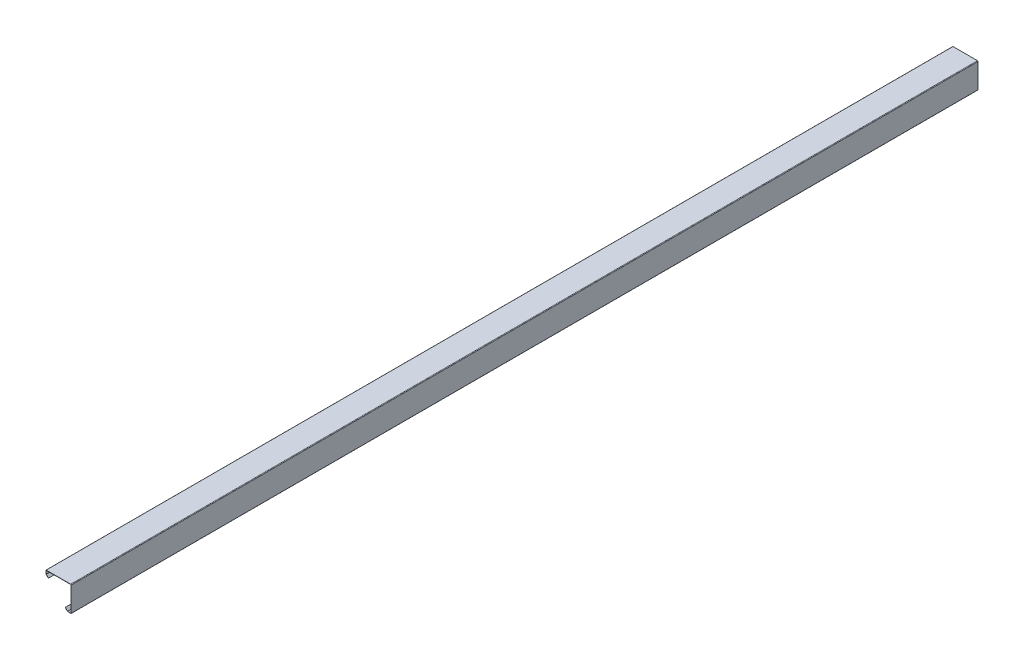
ISO-10303-21;
HEADER;
FILE_DESCRIPTION(('STEP AP214'),'2;1');
FILE_NAME('part.step','',(''),(''),'','','');
FILE_SCHEMA(('AUTOMOTIVE_DESIGN { 1 0 10303 214 1 1 1 1 }'));
ENDSEC;
DATA;
#1=APPLICATION_CONTEXT('core data for automotive mechanical design processes');
#2=APPLICATION_PROTOCOL_DEFINITION('international standard','automotive_design',2000,#1);
#3=PRODUCT_CONTEXT('',#1,'mechanical');
#4=PRODUCT('Part','Part','',(#3));
#5=PRODUCT_RELATED_PRODUCT_CATEGORY('part','',(#4));
#6=PRODUCT_DEFINITION_FORMATION('','',#4);
#7=PRODUCT_DEFINITION_CONTEXT('part definition',#1,'design');
#8=PRODUCT_DEFINITION('design','',#6,#7);
#9=PRODUCT_DEFINITION_SHAPE('','',#8);
#10=(LENGTH_UNIT() NAMED_UNIT(*) SI_UNIT(.MILLI.,.METRE.));
#11=(NAMED_UNIT(*) PLANE_ANGLE_UNIT() SI_UNIT($,.RADIAN.));
#12=(NAMED_UNIT(*) SI_UNIT($,.STERADIAN.) SOLID_ANGLE_UNIT());
#13=UNCERTAINTY_MEASURE_WITH_UNIT(LENGTH_MEASURE(1.E-05),#10,'distance_accuracy_value','');
#14=(GEOMETRIC_REPRESENTATION_CONTEXT(3) GLOBAL_UNCERTAINTY_ASSIGNED_CONTEXT((#13)) GLOBAL_UNIT_ASSIGNED_CONTEXT((#10,
#11,#12)) REPRESENTATION_CONTEXT('',''));
#15=CARTESIAN_POINT('',(0.,0.,0.));
#16=DIRECTION('',(0.,0.,1.));
#17=DIRECTION('',(1.,0.,0.));
#18=AXIS2_PLACEMENT_3D('',#15,#16,#17);
#19=CARTESIAN_POINT('',(-55.4417833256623,-8.22893583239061,2000.));
#20=DIRECTION('',(0.707106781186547,0.707106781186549,0.));
#21=DIRECTION('',(-0.707106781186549,0.707106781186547,0.));
#22=AXIS2_PLACEMENT_3D('',#19,#20,#21);
#23=PLANE('',#22);
#24=DIRECTION('',(0.707106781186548,-0.707106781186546,0.));
#25=VECTOR('',#24,1.);
#26=CARTESIAN_POINT('',(-55.4417833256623,-8.22893583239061,0.));
#27=LINE('',#26,#25);
#28=CARTESIAN_POINT('',(-55.4417833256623,-8.22893583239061,0.));
#29=VERTEX_POINT('',#28);
#30=CARTESIAN_POINT('',(-50.3903892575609,-13.280329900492,0.));
#31=VERTEX_POINT('',#30);
#32=EDGE_CURVE('E212',#29,#31,#27,.T.);
#33=ORIENTED_EDGE('',*,*,#32,.T.);
#34=DIRECTION('',(0.,0.,-1.));
#35=VECTOR('',#34,1.);
#36=CARTESIAN_POINT('',(-50.3903892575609,-13.280329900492,2000.));
#37=LINE('',#36,#35);
#38=CARTESIAN_POINT('',(-50.3903892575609,-13.280329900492,2000.));
#39=VERTEX_POINT('',#38);
#40=EDGE_CURVE('E13',#39,#31,#37,.T.);
#41=ORIENTED_EDGE('',*,*,#40,.F.);
#42=DIRECTION('',(0.707106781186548,-0.707106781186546,0.));
#43=VECTOR('',#42,1.);
#44=CARTESIAN_POINT('',(-55.4417833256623,-8.22893583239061,2000.));
#45=LINE('',#44,#43);
#46=CARTESIAN_POINT('',(-55.4417833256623,-8.22893583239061,2000.));
#47=VERTEX_POINT('',#46);
#48=EDGE_CURVE('E137',#47,#39,#45,.T.);
#49=ORIENTED_EDGE('',*,*,#48,.F.);
#50=DIRECTION('',(0.,0.,-1.));
#51=VECTOR('',#50,1.);
#52=CARTESIAN_POINT('',(-55.4417833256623,-8.22893583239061,2000.));
#53=LINE('',#52,#51);
#54=EDGE_CURVE('E208',#47,#29,#53,.T.);
#55=ORIENTED_EDGE('',*,*,#54,.T.);
#56=EDGE_LOOP('',(#33,#41,#49,#55));
#57=FACE_BOUND('',#56,.T.);
#58=ADVANCED_FACE('F45',(#57),#23,.F.);
#59=CARTESIAN_POINT('',(-50.0311790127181,-12.9211196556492,2000.));
#60=DIRECTION('',(0.707106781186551,-0.707106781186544,0.));
#61=DIRECTION('',(0.707106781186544,0.707106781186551,0.));
#62=AXIS2_PLACEMENT_3D('',#59,#60,#61);
#63=PLANE('',#62);
#64=DIRECTION('',(-0.707106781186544,-0.707106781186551,0.));
#65=VECTOR('',#64,1.);
#66=CARTESIAN_POINT('',(-50.0311790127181,-12.9211196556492,0.));
#67=LINE('',#66,#65);
#68=CARTESIAN_POINT('',(-50.0311790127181,-12.9211196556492,0.));
#69=VERTEX_POINT('',#68);
#70=EDGE_CURVE('E215',#69,#31,#67,.T.);
#71=ORIENTED_EDGE('',*,*,#70,.F.);
#72=DIRECTION('',(0.,0.,-1.));
#73=VECTOR('',#72,1.);
#74=CARTESIAN_POINT('',(-50.0311790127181,-12.9211196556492,2000.));
#75=LINE('',#74,#73);
#76=CARTESIAN_POINT('',(-50.0311790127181,-12.9211196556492,2000.));
#77=VERTEX_POINT('',#76);
#78=EDGE_CURVE('E53',#77,#69,#75,.T.);
#79=ORIENTED_EDGE('',*,*,#78,.F.);
#80=DIRECTION('',(-0.707106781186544,-0.707106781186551,0.));
#81=VECTOR('',#80,1.);
#82=CARTESIAN_POINT('',(-50.0311790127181,-12.9211196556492,2000.));
#83=LINE('',#82,#81);
#84=EDGE_CURVE('E317',#77,#39,#83,.T.);
#85=ORIENTED_EDGE('',*,*,#84,.T.);
#86=ORIENTED_EDGE('',*,*,#40,.T.);
#87=EDGE_LOOP('',(#71,#79,#85,#86));
#88=FACE_BOUND('',#87,.T.);
#89=ADVANCED_FACE('F304',(#88),#63,.T.);
#90=CARTESIAN_POINT('',(-55.0825730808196,-7.86972558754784,2000.));
#91=DIRECTION('',(0.707106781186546,0.707106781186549,0.));
#92=DIRECTION('',(-0.707106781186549,0.707106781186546,0.));
#93=AXIS2_PLACEMENT_3D('',#90,#91,#92);
#94=PLANE('',#93);
#95=DIRECTION('',(0.707106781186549,-0.707106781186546,0.));
#96=VECTOR('',#95,1.);
#97=CARTESIAN_POINT('',(-55.0825730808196,-7.86972558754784,0.));
#98=LINE('',#97,#96);
#99=CARTESIAN_POINT('',(-55.0545,-7.8977986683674,0.));
#100=VERTEX_POINT('',#99);
#101=EDGE_CURVE('E218',#100,#69,#98,.T.);
#102=ORIENTED_EDGE('',*,*,#101,.F.);
#103=DIRECTION('',(0.,0.,-1.));
#104=VECTOR('',#103,1.);
#105=CARTESIAN_POINT('',(-55.0545,-7.8977986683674,2000.));
#106=LINE('',#105,#104);
#107=CARTESIAN_POINT('',(-55.0545,-7.8977986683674,2000.));
#108=VERTEX_POINT('',#107);
#109=EDGE_CURVE('E294',#108,#100,#106,.T.);
#110=ORIENTED_EDGE('',*,*,#109,.F.);
#111=DIRECTION('',(0.707106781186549,-0.707106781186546,0.));
#112=VECTOR('',#111,1.);
#113=CARTESIAN_POINT('',(-55.0825730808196,-7.86972558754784,2000.));
#114=LINE('',#113,#112);
#115=EDGE_CURVE('E301',#108,#77,#114,.T.);
#116=ORIENTED_EDGE('',*,*,#115,.T.);
#117=ORIENTED_EDGE('',*,*,#78,.T.);
#118=EDGE_LOOP('',(#102,#110,#116,#117));
#119=FACE_BOUND('',#118,.T.);
#120=ADVANCED_FACE('F299',(#119),#94,.T.);
#121=CARTESIAN_POINT('',(-55.0545,-0.412152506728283,2000.));
#122=DIRECTION('',(1.,0.,0.));
#123=DIRECTION('',(0.,0.,-1.));
#124=AXIS2_PLACEMENT_3D('',#121,#122,#123);
#125=PLANE('',#124);
#126=DIRECTION('',(0.,1.,0.));
#127=VECTOR('',#126,1.);
#128=CARTESIAN_POINT('',(-55.0545,-0.412152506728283,0.));
#129=LINE('',#128,#127);
#130=CARTESIAN_POINT('',(-55.0545,-0.508000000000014,0.));
#131=VERTEX_POINT('',#130);
#132=EDGE_CURVE('E221',#131,#100,#129,.F.);
#133=ORIENTED_EDGE('',*,*,#132,.F.);
#134=DIRECTION('',(0.,0.,-1.));
#135=VECTOR('',#134,1.);
#136=CARTESIAN_POINT('',(-55.0545,-0.508000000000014,2000.));
#137=LINE('',#136,#135);
#138=CARTESIAN_POINT('',(-55.0545,-0.508000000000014,2000.));
#139=VERTEX_POINT('',#138);
#140=EDGE_CURVE('E292',#139,#131,#137,.T.);
#141=ORIENTED_EDGE('',*,*,#140,.F.);
#142=DIRECTION('',(0.,1.,0.));
#143=VECTOR('',#142,1.);
#144=CARTESIAN_POINT('',(-55.0545,-0.412152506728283,2000.));
#145=LINE('',#144,#143);
#146=EDGE_CURVE('E314',#139,#108,#145,.F.);
#147=ORIENTED_EDGE('',*,*,#146,.T.);
#148=ORIENTED_EDGE('',*,*,#109,.T.);
#149=EDGE_LOOP('',(#133,#141,#147,#148));
#150=FACE_BOUND('',#149,.T.);
#151=ADVANCED_FACE('F311',(#150),#125,.T.);
#152=CARTESIAN_POINT('',(-55.1503474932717,-0.508000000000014,2000.));
#153=DIRECTION('',(0.,-1.,0.));
#154=DIRECTION('',(1.,0.,0.));
#155=AXIS2_PLACEMENT_3D('',#152,#153,#154);
#156=PLANE('',#155);
#157=DIRECTION('',(-1.,0.,0.));
#158=VECTOR('',#157,1.);
#159=CARTESIAN_POINT('',(-55.1503474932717,-0.508000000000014,0.));
#160=LINE('',#159,#158);
#161=CARTESIAN_POINT('',(-1.27000000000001,-0.508,0.));
#162=VERTEX_POINT('',#161);
#163=EDGE_CURVE('E224',#162,#131,#160,.T.);
#164=ORIENTED_EDGE('',*,*,#163,.F.);
#165=DIRECTION('',(0.,0.,-1.));
#166=VECTOR('',#165,1.);
#167=CARTESIAN_POINT('',(-1.27000000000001,-0.508,2000.));
#168=LINE('',#167,#166);
#169=CARTESIAN_POINT('',(-1.27000000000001,-0.508,2000.));
#170=VERTEX_POINT('',#169);
#171=EDGE_CURVE('E290',#170,#162,#168,.T.);
#172=ORIENTED_EDGE('',*,*,#171,.F.);
#173=DIRECTION('',(-1.,0.,0.));
#174=VECTOR('',#173,1.);
#175=CARTESIAN_POINT('',(-55.1503474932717,-0.508000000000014,2000.));
#176=LINE('',#175,#174);
#177=EDGE_CURVE('E319',#170,#139,#176,.T.);
#178=ORIENTED_EDGE('',*,*,#177,.T.);
#179=ORIENTED_EDGE('',*,*,#140,.T.);
#180=EDGE_LOOP('',(#164,#172,#178,#179));
#181=FACE_BOUND('',#180,.T.);
#182=ADVANCED_FACE('F383',(#181),#156,.T.);
#183=CARTESIAN_POINT('',(-1.27000000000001,-1.27000000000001,2000.));
#184=DIRECTION('',(0.,0.,-1.));
#185=DIRECTION('',(-1.,0.,0.));
#186=AXIS2_PLACEMENT_3D('',#183,#184,#185);
#187=CYLINDRICAL_SURFACE('',#186,0.762000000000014);
#188=CARTESIAN_POINT('',(-1.27000000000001,-1.27000000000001,0.));
#189=DIRECTION('',(0.,0.,1.));
#190=DIRECTION('',(1.,0.,0.));
#191=AXIS2_PLACEMENT_3D('',#188,#189,#190);
#192=CIRCLE('',#191,0.762000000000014);
#193=CARTESIAN_POINT('',(-0.508,-1.27000000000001,0.));
#194=VERTEX_POINT('',#193);
#195=EDGE_CURVE('E227',#194,#162,#192,.T.);
#196=ORIENTED_EDGE('',*,*,#195,.F.);
#197=DIRECTION('',(0.,0.,-1.));
#198=VECTOR('',#197,1.);
#199=CARTESIAN_POINT('',(-0.508,-1.27000000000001,2000.));
#200=LINE('',#199,#198);
#201=CARTESIAN_POINT('',(-0.508,-1.27000000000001,2000.));
#202=VERTEX_POINT('',#201);
#203=EDGE_CURVE('E288',#202,#194,#200,.T.);
#204=ORIENTED_EDGE('',*,*,#203,.F.);
#205=CARTESIAN_POINT('',(-1.27000000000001,-1.27000000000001,2000.));
#206=DIRECTION('',(0.,0.,1.));
#207=DIRECTION('',(1.,0.,0.));
#208=AXIS2_PLACEMENT_3D('',#205,#206,#207);
#209=CIRCLE('',#208,0.762000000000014);
#210=EDGE_CURVE('E325',#202,#170,#209,.T.);
#211=ORIENTED_EDGE('',*,*,#210,.T.);
#212=ORIENTED_EDGE('',*,*,#171,.T.);
#213=EDGE_LOOP('',(#196,#204,#211,#212));
#214=FACE_BOUND('',#213,.T.);
#215=ADVANCED_FACE('F386',(#214),#187,.F.);
#216=CARTESIAN_POINT('',(-0.508,-55.1503474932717,2000.));
#217=DIRECTION('',(-1.,0.,0.));
#218=DIRECTION('',(0.,-1.,0.));
#219=AXIS2_PLACEMENT_3D('',#216,#217,#218);
#220=PLANE('',#219);
#221=DIRECTION('',(0.,1.,0.));
#222=VECTOR('',#221,1.);
#223=CARTESIAN_POINT('',(-0.508,-55.1503474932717,0.));
#224=LINE('',#223,#222);
#225=CARTESIAN_POINT('',(-0.508,-55.0545,0.));
#226=VERTEX_POINT('',#225);
#227=EDGE_CURVE('E230',#226,#194,#224,.T.);
#228=ORIENTED_EDGE('',*,*,#227,.F.);
#229=DIRECTION('',(0.,0.,-1.));
#230=VECTOR('',#229,1.);
#231=CARTESIAN_POINT('',(-0.508,-55.0545,2000.));
#232=LINE('',#231,#230);
#233=CARTESIAN_POINT('',(-0.508,-55.0545,2000.));
#234=VERTEX_POINT('',#233);
#235=EDGE_CURVE('E286',#234,#226,#232,.T.);
#236=ORIENTED_EDGE('',*,*,#235,.F.);
#237=DIRECTION('',(0.,1.,0.));
#238=VECTOR('',#237,1.);
#239=CARTESIAN_POINT('',(-0.508,-55.1503474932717,2000.));
#240=LINE('',#239,#238);
#241=EDGE_CURVE('E328',#234,#202,#240,.T.);
#242=ORIENTED_EDGE('',*,*,#241,.T.);
#243=ORIENTED_EDGE('',*,*,#203,.T.);
#244=EDGE_LOOP('',(#228,#236,#242,#243));
#245=FACE_BOUND('',#244,.T.);
#246=ADVANCED_FACE('F390',(#245),#220,.T.);
#247=CARTESIAN_POINT('',(-0.412152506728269,-55.0545,2000.));
#248=DIRECTION('',(0.,1.,0.));
#249=DIRECTION('',(0.,0.,1.));
#250=AXIS2_PLACEMENT_3D('',#247,#248,#249);
#251=PLANE('',#250);
#252=DIRECTION('',(1.,0.,0.));
#253=VECTOR('',#252,1.);
#254=CARTESIAN_POINT('',(-0.412152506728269,-55.0545,0.));
#255=LINE('',#254,#253);
#256=CARTESIAN_POINT('',(-7.89779866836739,-55.0545,0.));
#257=VERTEX_POINT('',#256);
#258=EDGE_CURVE('E233',#257,#226,#255,.T.);
#259=ORIENTED_EDGE('',*,*,#258,.F.);
#260=DIRECTION('',(0.,0.,-1.));
#261=VECTOR('',#260,1.);
#262=CARTESIAN_POINT('',(-7.89779866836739,-55.0545,2000.));
#263=LINE('',#262,#261);
#264=CARTESIAN_POINT('',(-7.89779866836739,-55.0545,2000.));
#265=VERTEX_POINT('',#264);
#266=EDGE_CURVE('E284',#265,#257,#263,.T.);
#267=ORIENTED_EDGE('',*,*,#266,.F.);
#268=DIRECTION('',(1.,0.,0.));
#269=VECTOR('',#268,1.);
#270=CARTESIAN_POINT('',(-0.412152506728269,-55.0545,2000.));
#271=LINE('',#270,#269);
#272=EDGE_CURVE('E331',#265,#234,#271,.T.);
#273=ORIENTED_EDGE('',*,*,#272,.T.);
#274=ORIENTED_EDGE('',*,*,#235,.T.);
#275=EDGE_LOOP('',(#259,#267,#273,#274));
#276=FACE_BOUND('',#275,.T.);
#277=ADVANCED_FACE('F394',(#276),#251,.T.);
#278=CARTESIAN_POINT('',(-7.86972558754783,-55.0825730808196,2000.));
#279=DIRECTION('',(0.707106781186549,0.707106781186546,0.));
#280=DIRECTION('',(-0.707106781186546,0.707106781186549,0.));
#281=AXIS2_PLACEMENT_3D('',#278,#279,#280);
#282=PLANE('',#281);
#283=DIRECTION('',(0.707106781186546,-0.707106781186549,0.));
#284=VECTOR('',#283,1.);
#285=CARTESIAN_POINT('',(-7.86972558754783,-55.0825730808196,0.));
#286=LINE('',#285,#284);
#287=CARTESIAN_POINT('',(-12.9211196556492,-50.0311790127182,0.));
#288=VERTEX_POINT('',#287);
#289=EDGE_CURVE('E236',#288,#257,#286,.T.);
#290=ORIENTED_EDGE('',*,*,#289,.F.);
#291=DIRECTION('',(0.,0.,-1.));
#292=VECTOR('',#291,1.);
#293=CARTESIAN_POINT('',(-12.9211196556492,-50.0311790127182,2000.));
#294=LINE('',#293,#292);
#295=CARTESIAN_POINT('',(-12.9211196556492,-50.0311790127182,2000.));
#296=VERTEX_POINT('',#295);
#297=EDGE_CURVE('E282',#296,#288,#294,.T.);
#298=ORIENTED_EDGE('',*,*,#297,.F.);
#299=DIRECTION('',(0.707106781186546,-0.707106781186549,0.));
#300=VECTOR('',#299,1.);
#301=CARTESIAN_POINT('',(-7.86972558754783,-55.0825730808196,2000.));
#302=LINE('',#301,#300);
#303=EDGE_CURVE('E334',#296,#265,#302,.T.);
#304=ORIENTED_EDGE('',*,*,#303,.T.);
#305=ORIENTED_EDGE('',*,*,#266,.T.);
#306=EDGE_LOOP('',(#290,#298,#304,#305));
#307=FACE_BOUND('',#306,.T.);
#308=ADVANCED_FACE('F398',(#307),#282,.T.);
#309=CARTESIAN_POINT('',(-13.280329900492,-50.3903892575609,2000.));
#310=DIRECTION('',(-0.707106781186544,0.707106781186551,0.));
#311=DIRECTION('',(-0.707106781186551,-0.707106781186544,0.));
#312=AXIS2_PLACEMENT_3D('',#309,#310,#311);
#313=PLANE('',#312);
#314=DIRECTION('',(0.707106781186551,0.707106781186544,0.));
#315=VECTOR('',#314,1.);
#316=CARTESIAN_POINT('',(-13.280329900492,-50.3903892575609,0.));
#317=LINE('',#316,#315);
#318=CARTESIAN_POINT('',(-13.280329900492,-50.3903892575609,0.));
#319=VERTEX_POINT('',#318);
#320=EDGE_CURVE('E239',#319,#288,#317,.T.);
#321=ORIENTED_EDGE('',*,*,#320,.F.);
#322=DIRECTION('',(0.,0.,-1.));
#323=VECTOR('',#322,1.);
#324=CARTESIAN_POINT('',(-13.280329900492,-50.3903892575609,2000.));
#325=LINE('',#324,#323);
#326=CARTESIAN_POINT('',(-13.280329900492,-50.3903892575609,2000.));
#327=VERTEX_POINT('',#326);
#328=EDGE_CURVE('E280',#327,#319,#325,.T.);
#329=ORIENTED_EDGE('',*,*,#328,.F.);
#330=DIRECTION('',(0.707106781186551,0.707106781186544,0.));
#331=VECTOR('',#330,1.);
#332=CARTESIAN_POINT('',(-13.280329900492,-50.3903892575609,2000.));
#333=LINE('',#332,#331);
#334=EDGE_CURVE('E337',#327,#296,#333,.T.);
#335=ORIENTED_EDGE('',*,*,#334,.T.);
#336=ORIENTED_EDGE('',*,*,#297,.T.);
#337=EDGE_LOOP('',(#321,#329,#335,#336));
#338=FACE_BOUND('',#337,.T.);
#339=ADVANCED_FACE('F402',(#338),#313,.T.);
#340=CARTESIAN_POINT('',(-8.2289358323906,-55.4417833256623,2000.));
#341=DIRECTION('',(0.707106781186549,0.707106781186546,0.));
#342=DIRECTION('',(-0.707106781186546,0.707106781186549,0.));
#343=AXIS2_PLACEMENT_3D('',#340,#341,#342);
#344=PLANE('',#343);
#345=DIRECTION('',(0.707106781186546,-0.707106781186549,0.));
#346=VECTOR('',#345,1.);
#347=CARTESIAN_POINT('',(-8.2289358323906,-55.4417833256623,0.));
#348=LINE('',#347,#346);
#349=CARTESIAN_POINT('',(-8.2289358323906,-55.4417833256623,0.));
#350=VERTEX_POINT('',#349);
#351=EDGE_CURVE('E242',#319,#350,#348,.T.);
#352=ORIENTED_EDGE('',*,*,#351,.T.);
#353=DIRECTION('',(0.,0.,-1.));
#354=VECTOR('',#353,1.);
#355=CARTESIAN_POINT('',(-8.2289358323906,-55.4417833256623,2000.));
#356=LINE('',#355,#354);
#357=CARTESIAN_POINT('',(-8.2289358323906,-55.4417833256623,2000.));
#358=VERTEX_POINT('',#357);
#359=EDGE_CURVE('E277',#358,#350,#356,.T.);
#360=ORIENTED_EDGE('',*,*,#359,.F.);
#361=DIRECTION('',(0.707106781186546,-0.707106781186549,0.));
#362=VECTOR('',#361,1.);
#363=CARTESIAN_POINT('',(-8.2289358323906,-55.4417833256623,2000.));
#364=LINE('',#363,#362);
#365=EDGE_CURVE('E340',#327,#358,#364,.T.);
#366=ORIENTED_EDGE('',*,*,#365,.F.);
#367=ORIENTED_EDGE('',*,*,#328,.T.);
#368=EDGE_LOOP('',(#352,#360,#366,#367));
#369=FACE_BOUND('',#368,.T.);
#370=ADVANCED_FACE('F406',(#369),#344,.F.);
#371=CARTESIAN_POINT('',(-7.9375,-55.1503474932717,2000.));
#372=DIRECTION('',(0.,0.,-1.));
#373=DIRECTION('',(-1.,0.,0.));
#374=AXIS2_PLACEMENT_3D('',#371,#372,#373);
#375=CYLINDRICAL_SURFACE('',#374,0.41215250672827);
#376=CARTESIAN_POINT('',(-7.9375,-55.1503474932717,0.));
#377=DIRECTION('',(0.,0.,1.));
#378=DIRECTION('',(-1.,0.,0.));
#379=AXIS2_PLACEMENT_3D('',#376,#377,#378);
#380=CIRCLE('',#379,0.41215250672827);
#381=CARTESIAN_POINT('',(-7.9375,-55.5625,0.));
#382=VERTEX_POINT('',#381);
#383=EDGE_CURVE('E244',#350,#382,#380,.T.);
#384=ORIENTED_EDGE('',*,*,#383,.T.);
#385=DIRECTION('',(0.,0.,-1.));
#386=VECTOR('',#385,1.);
#387=CARTESIAN_POINT('',(-7.9375,-55.5625,2000.));
#388=LINE('',#387,#386);
#389=CARTESIAN_POINT('',(-7.9375,-55.5625,2000.));
#390=VERTEX_POINT('',#389);
#391=EDGE_CURVE('E274',#390,#382,#388,.T.);
#392=ORIENTED_EDGE('',*,*,#391,.F.);
#393=CARTESIAN_POINT('',(-7.9375,-55.1503474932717,2000.));
#394=DIRECTION('',(0.,0.,1.));
#395=DIRECTION('',(-1.,0.,0.));
#396=AXIS2_PLACEMENT_3D('',#393,#394,#395);
#397=CIRCLE('',#396,0.41215250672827);
#398=EDGE_CURVE('E342',#358,#390,#397,.T.);
#399=ORIENTED_EDGE('',*,*,#398,.F.);
#400=ORIENTED_EDGE('',*,*,#359,.T.);
#401=EDGE_LOOP('',(#384,#392,#399,#400));
#402=FACE_BOUND('',#401,.T.);
#403=ADVANCED_FACE('F410',(#402),#375,.T.);
#404=CARTESIAN_POINT('',(-0.412152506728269,-55.5625,2000.));
#405=DIRECTION('',(0.,1.,0.));
#406=DIRECTION('',(0.,0.,1.));
#407=AXIS2_PLACEMENT_3D('',#404,#405,#406);
#408=PLANE('',#407);
#409=DIRECTION('',(1.,0.,0.));
#410=VECTOR('',#409,1.);
#411=CARTESIAN_POINT('',(-0.412152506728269,-55.5625,0.));
#412=LINE('',#411,#410);
#413=CARTESIAN_POINT('',(-0.412152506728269,-55.5625,0.));
#414=VERTEX_POINT('',#413);
#415=EDGE_CURVE('E246',#382,#414,#412,.T.);
#416=ORIENTED_EDGE('',*,*,#415,.T.);
#417=DIRECTION('',(0.,0.,-1.));
#418=VECTOR('',#417,1.);
#419=CARTESIAN_POINT('',(-0.412152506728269,-55.5625,2000.));
#420=LINE('',#419,#418);
#421=CARTESIAN_POINT('',(-0.412152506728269,-55.5625,2000.));
#422=VERTEX_POINT('',#421);
#423=EDGE_CURVE('E271',#422,#414,#420,.T.);
#424=ORIENTED_EDGE('',*,*,#423,.F.);
#425=DIRECTION('',(1.,0.,0.));
#426=VECTOR('',#425,1.);
#427=CARTESIAN_POINT('',(-0.412152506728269,-55.5625,2000.));
#428=LINE('',#427,#426);
#429=EDGE_CURVE('E344',#390,#422,#428,.T.);
#430=ORIENTED_EDGE('',*,*,#429,.F.);
#431=ORIENTED_EDGE('',*,*,#391,.T.);
#432=EDGE_LOOP('',(#416,#424,#430,#431));
#433=FACE_BOUND('',#432,.T.);
#434=ADVANCED_FACE('F414',(#433),#408,.F.);
#435=CARTESIAN_POINT('',(-0.412152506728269,-55.1503474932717,2000.));
#436=DIRECTION('',(0.,0.,-1.));
#437=DIRECTION('',(-1.,0.,0.));
#438=AXIS2_PLACEMENT_3D('',#435,#436,#437);
#439=CYLINDRICAL_SURFACE('',#438,0.412152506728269);
#440=CARTESIAN_POINT('',(-0.412152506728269,-55.1503474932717,0.));
#441=DIRECTION('',(0.,0.,1.));
#442=DIRECTION('',(1.,0.,0.));
#443=AXIS2_PLACEMENT_3D('',#440,#441,#442);
#444=CIRCLE('',#443,0.412152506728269);
#445=CARTESIAN_POINT('',(0.,-55.1503474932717,0.));
#446=VERTEX_POINT('',#445);
#447=EDGE_CURVE('E248',#414,#446,#444,.T.);
#448=ORIENTED_EDGE('',*,*,#447,.T.);
#449=DIRECTION('',(0.,0.,-1.));
#450=VECTOR('',#449,1.);
#451=CARTESIAN_POINT('',(0.,-55.1503474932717,2000.));
#452=LINE('',#451,#450);
#453=CARTESIAN_POINT('',(0.,-55.1503474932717,2000.));
#454=VERTEX_POINT('',#453);
#455=EDGE_CURVE('E268',#454,#446,#452,.T.);
#456=ORIENTED_EDGE('',*,*,#455,.F.);
#457=CARTESIAN_POINT('',(-0.412152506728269,-55.1503474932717,2000.));
#458=DIRECTION('',(0.,0.,1.));
#459=DIRECTION('',(1.,0.,0.));
#460=AXIS2_PLACEMENT_3D('',#457,#458,#459);
#461=CIRCLE('',#460,0.412152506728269);
#462=EDGE_CURVE('E346',#422,#454,#461,.T.);
#463=ORIENTED_EDGE('',*,*,#462,.F.);
#464=ORIENTED_EDGE('',*,*,#423,.T.);
#465=EDGE_LOOP('',(#448,#456,#463,#464));
#466=FACE_BOUND('',#465,.T.);
#467=ADVANCED_FACE('F418',(#466),#439,.T.);
#468=CARTESIAN_POINT('',(0.,-55.1503474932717,2000.));
#469=DIRECTION('',(-1.,0.,0.));
#470=DIRECTION('',(0.,-1.,0.));
#471=AXIS2_PLACEMENT_3D('',#468,#469,#470);
#472=PLANE('',#471);
#473=DIRECTION('',(0.,1.,0.));
#474=VECTOR('',#473,1.);
#475=CARTESIAN_POINT('',(0.,-55.1503474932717,0.));
#476=LINE('',#475,#474);
#477=CARTESIAN_POINT('',(0.,-1.27000000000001,0.));
#478=VERTEX_POINT('',#477);
#479=EDGE_CURVE('E250',#446,#478,#476,.T.);
#480=ORIENTED_EDGE('',*,*,#479,.T.);
#481=DIRECTION('',(0.,0.,-1.));
#482=VECTOR('',#481,1.);
#483=CARTESIAN_POINT('',(0.,-1.27000000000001,2000.));
#484=LINE('',#483,#482);
#485=CARTESIAN_POINT('',(0.,-1.27000000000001,2000.));
#486=VERTEX_POINT('',#485);
#487=EDGE_CURVE('E265',#486,#478,#484,.T.);
#488=ORIENTED_EDGE('',*,*,#487,.F.);
#489=DIRECTION('',(0.,1.,0.));
#490=VECTOR('',#489,1.);
#491=CARTESIAN_POINT('',(0.,-55.1503474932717,2000.));
#492=LINE('',#491,#490);
#493=EDGE_CURVE('E348',#454,#486,#492,.T.);
#494=ORIENTED_EDGE('',*,*,#493,.F.);
#495=ORIENTED_EDGE('',*,*,#455,.T.);
#496=EDGE_LOOP('',(#480,#488,#494,#495));
#497=FACE_BOUND('',#496,.T.);
#498=ADVANCED_FACE('F422',(#497),#472,.F.);
#499=CARTESIAN_POINT('',(-1.27000000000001,-1.27000000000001,2000.));
#500=DIRECTION('',(0.,0.,-1.));
#501=DIRECTION('',(-1.,0.,0.));
#502=AXIS2_PLACEMENT_3D('',#499,#500,#501);
#503=CYLINDRICAL_SURFACE('',#502,1.27000000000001);
#504=CARTESIAN_POINT('',(-1.27000000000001,-1.27000000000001,0.));
#505=DIRECTION('',(0.,0.,1.));
#506=DIRECTION('',(1.,0.,0.));
#507=AXIS2_PLACEMENT_3D('',#504,#505,#506);
#508=CIRCLE('',#507,1.27000000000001);
#509=CARTESIAN_POINT('',(-1.27000000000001,0.,0.));
#510=VERTEX_POINT('',#509);
#511=EDGE_CURVE('E252',#478,#510,#508,.T.);
#512=ORIENTED_EDGE('',*,*,#511,.T.);
#513=DIRECTION('',(0.,0.,-1.));
#514=VECTOR('',#513,1.);
#515=CARTESIAN_POINT('',(-1.27000000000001,0.,2000.));
#516=LINE('',#515,#514);
#517=CARTESIAN_POINT('',(-1.27000000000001,0.,2000.));
#518=VERTEX_POINT('',#517);
#519=EDGE_CURVE('E262',#518,#510,#516,.T.);
#520=ORIENTED_EDGE('',*,*,#519,.F.);
#521=CARTESIAN_POINT('',(-1.27000000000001,-1.27000000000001,2000.));
#522=DIRECTION('',(0.,0.,1.));
#523=DIRECTION('',(1.,0.,0.));
#524=AXIS2_PLACEMENT_3D('',#521,#522,#523);
#525=CIRCLE('',#524,1.27000000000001);
#526=EDGE_CURVE('E350',#486,#518,#525,.T.);
#527=ORIENTED_EDGE('',*,*,#526,.F.);
#528=ORIENTED_EDGE('',*,*,#487,.T.);
#529=EDGE_LOOP('',(#512,#520,#527,#528));
#530=FACE_BOUND('',#529,.T.);
#531=ADVANCED_FACE('F356',(#530),#503,.T.);
#532=CARTESIAN_POINT('',(-55.1503474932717,0.,2000.));
#533=DIRECTION('',(0.,-1.,0.));
#534=DIRECTION('',(1.,0.,0.));
#535=AXIS2_PLACEMENT_3D('',#532,#533,#534);
#536=PLANE('',#535);
#537=DIRECTION('',(-1.,0.,0.));
#538=VECTOR('',#537,1.);
#539=CARTESIAN_POINT('',(-55.1503474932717,0.,0.));
#540=LINE('',#539,#538);
#541=CARTESIAN_POINT('',(-55.1503474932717,0.,0.));
#542=VERTEX_POINT('',#541);
#543=EDGE_CURVE('E254',#510,#542,#540,.T.);
#544=ORIENTED_EDGE('',*,*,#543,.T.);
#545=DIRECTION('',(0.,0.,-1.));
#546=VECTOR('',#545,1.);
#547=CARTESIAN_POINT('',(-55.1503474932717,0.,2000.));
#548=LINE('',#547,#546);
#549=CARTESIAN_POINT('',(-55.1503474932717,0.,2000.));
#550=VERTEX_POINT('',#549);
#551=EDGE_CURVE('E203',#550,#542,#548,.T.);
#552=ORIENTED_EDGE('',*,*,#551,.F.);
#553=DIRECTION('',(-1.,0.,0.));
#554=VECTOR('',#553,1.);
#555=CARTESIAN_POINT('',(-55.1503474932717,0.,2000.));
#556=LINE('',#555,#554);
#557=EDGE_CURVE('E194',#518,#550,#556,.T.);
#558=ORIENTED_EDGE('',*,*,#557,.F.);
#559=ORIENTED_EDGE('',*,*,#519,.T.);
#560=EDGE_LOOP('',(#544,#552,#558,#559));
#561=FACE_BOUND('',#560,.T.);
#562=ADVANCED_FACE('F360',(#561),#536,.F.);
#563=CARTESIAN_POINT('',(-55.1503474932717,-0.412152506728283,2000.));
#564=DIRECTION('',(0.,0.,-1.));
#565=DIRECTION('',(-1.,0.,0.));
#566=AXIS2_PLACEMENT_3D('',#563,#564,#565);
#567=CYLINDRICAL_SURFACE('',#566,0.412152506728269);
#568=CARTESIAN_POINT('',(-55.1503474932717,-0.412152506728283,0.));
#569=DIRECTION('',(0.,0.,1.));
#570=DIRECTION('',(1.,0.,0.));
#571=AXIS2_PLACEMENT_3D('',#568,#569,#570);
#572=CIRCLE('',#571,0.412152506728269);
#573=CARTESIAN_POINT('',(-55.5625,-0.412152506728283,0.));
#574=VERTEX_POINT('',#573);
#575=EDGE_CURVE('E202',#542,#574,#572,.T.);
#576=ORIENTED_EDGE('',*,*,#575,.T.);
#577=DIRECTION('',(0.,0.,-1.));
#578=VECTOR('',#577,1.);
#579=CARTESIAN_POINT('',(-55.5625,-0.412152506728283,2000.));
#580=LINE('',#579,#578);
#581=CARTESIAN_POINT('',(-55.5625,-0.412152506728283,2000.));
#582=VERTEX_POINT('',#581);
#583=EDGE_CURVE('E199',#582,#574,#580,.T.);
#584=ORIENTED_EDGE('',*,*,#583,.F.);
#585=CARTESIAN_POINT('',(-55.1503474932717,-0.412152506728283,2000.));
#586=DIRECTION('',(0.,0.,1.));
#587=DIRECTION('',(1.,0.,0.));
#588=AXIS2_PLACEMENT_3D('',#585,#586,#587);
#589=CIRCLE('',#588,0.412152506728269);
#590=EDGE_CURVE('E188',#550,#582,#589,.T.);
#591=ORIENTED_EDGE('',*,*,#590,.F.);
#592=ORIENTED_EDGE('',*,*,#551,.T.);
#593=EDGE_LOOP('',(#576,#584,#591,#592));
#594=FACE_BOUND('',#593,.T.);
#595=ADVANCED_FACE('F200',(#594),#567,.T.);
#596=CARTESIAN_POINT('',(-55.5625,-0.412152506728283,2000.));
#597=DIRECTION('',(1.,0.,0.));
#598=DIRECTION('',(0.,0.,-1.));
#599=AXIS2_PLACEMENT_3D('',#596,#597,#598);
#600=PLANE('',#599);
#601=DIRECTION('',(0.,-1.,0.));
#602=VECTOR('',#601,1.);
#603=CARTESIAN_POINT('',(-55.5625,-0.412152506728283,0.));
#604=LINE('',#603,#602);
#605=CARTESIAN_POINT('',(-55.5625,-7.93750000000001,0.));
#606=VERTEX_POINT('',#605);
#607=EDGE_CURVE('E125',#574,#606,#604,.T.);
#608=ORIENTED_EDGE('',*,*,#607,.T.);
#609=DIRECTION('',(0.,0.,-1.));
#610=VECTOR('',#609,1.);
#611=CARTESIAN_POINT('',(-55.5625,-7.93750000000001,2000.));
#612=LINE('',#611,#610);
#613=CARTESIAN_POINT('',(-55.5625,-7.93750000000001,2000.));
#614=VERTEX_POINT('',#613);
#615=EDGE_CURVE('E204',#614,#606,#612,.T.);
#616=ORIENTED_EDGE('',*,*,#615,.F.);
#617=DIRECTION('',(0.,-1.,0.));
#618=VECTOR('',#617,1.);
#619=CARTESIAN_POINT('',(-55.5625,-0.412152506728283,2000.));
#620=LINE('',#619,#618);
#621=EDGE_CURVE('E192',#582,#614,#620,.T.);
#622=ORIENTED_EDGE('',*,*,#621,.F.);
#623=ORIENTED_EDGE('',*,*,#583,.T.);
#624=EDGE_LOOP('',(#608,#616,#622,#623));
#625=FACE_BOUND('',#624,.T.);
#626=ADVANCED_FACE('F206',(#625),#600,.F.);
#627=CARTESIAN_POINT('',(-55.1503474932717,-7.93750000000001,2000.));
#628=DIRECTION('',(0.,0.,-1.));
#629=DIRECTION('',(-1.,0.,0.));
#630=AXIS2_PLACEMENT_3D('',#627,#628,#629);
#631=CYLINDRICAL_SURFACE('',#630,0.41215250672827);
#632=CARTESIAN_POINT('',(-55.1503474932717,-7.93750000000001,0.));
#633=DIRECTION('',(0.,0.,1.));
#634=DIRECTION('',(-1.,0.,0.));
#635=AXIS2_PLACEMENT_3D('',#632,#633,#634);
#636=CIRCLE('',#635,0.41215250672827);
#637=EDGE_CURVE('E131',#606,#29,#636,.T.);
#638=ORIENTED_EDGE('',*,*,#637,.T.);
#639=ORIENTED_EDGE('',*,*,#54,.F.);
#640=CARTESIAN_POINT('',(-55.1503474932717,-7.93750000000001,2000.));
#641=DIRECTION('',(0.,0.,1.));
#642=DIRECTION('',(-1.,0.,0.));
#643=AXIS2_PLACEMENT_3D('',#640,#641,#642);
#644=CIRCLE('',#643,0.41215250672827);
#645=EDGE_CURVE('E61',#614,#47,#644,.T.);
#646=ORIENTED_EDGE('',*,*,#645,.F.);
#647=ORIENTED_EDGE('',*,*,#615,.T.);
#648=EDGE_LOOP('',(#638,#639,#646,#647));
#649=FACE_BOUND('',#648,.T.);
#650=ADVANCED_FACE('F362',(#649),#631,.T.);
#651=CARTESIAN_POINT('',(-1.27000000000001,-1.27000000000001,2000.));
#652=DIRECTION('',(0.,0.,1.));
#653=DIRECTION('',(1.,0.,0.));
#654=AXIS2_PLACEMENT_3D('',#651,#652,#653);
#655=PLANE('',#654);
#656=ORIENTED_EDGE('',*,*,#48,.T.);
#657=ORIENTED_EDGE('',*,*,#84,.F.);
#658=ORIENTED_EDGE('',*,*,#115,.F.);
#659=ORIENTED_EDGE('',*,*,#146,.F.);
#660=ORIENTED_EDGE('',*,*,#177,.F.);
#661=ORIENTED_EDGE('',*,*,#210,.F.);
#662=ORIENTED_EDGE('',*,*,#241,.F.);
#663=ORIENTED_EDGE('',*,*,#272,.F.);
#664=ORIENTED_EDGE('',*,*,#303,.F.);
#665=ORIENTED_EDGE('',*,*,#334,.F.);
#666=ORIENTED_EDGE('',*,*,#365,.T.);
#667=ORIENTED_EDGE('',*,*,#398,.T.);
#668=ORIENTED_EDGE('',*,*,#429,.T.);
#669=ORIENTED_EDGE('',*,*,#462,.T.);
#670=ORIENTED_EDGE('',*,*,#493,.T.);
#671=ORIENTED_EDGE('',*,*,#526,.T.);
#672=ORIENTED_EDGE('',*,*,#557,.T.);
#673=ORIENTED_EDGE('',*,*,#590,.T.);
#674=ORIENTED_EDGE('',*,*,#621,.T.);
#675=ORIENTED_EDGE('',*,*,#645,.T.);
#676=EDGE_LOOP('',(#656,#657,#658,#659,#660,#661,#662,#663,#664,#665,#666,#667,#668,#669,#670,
#671,#672,#673,#674,#675));
#677=FACE_BOUND('',#676,.T.);
#678=ADVANCED_FACE('F190',(#677),#655,.T.);
#679=CARTESIAN_POINT('',(-1.27000000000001,-1.27000000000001,0.));
#680=DIRECTION('',(0.,0.,1.));
#681=DIRECTION('',(1.,0.,0.));
#682=AXIS2_PLACEMENT_3D('',#679,#680,#681);
#683=PLANE('',#682);
#684=ORIENTED_EDGE('',*,*,#32,.F.);
#685=ORIENTED_EDGE('',*,*,#637,.F.);
#686=ORIENTED_EDGE('',*,*,#607,.F.);
#687=ORIENTED_EDGE('',*,*,#575,.F.);
#688=ORIENTED_EDGE('',*,*,#543,.F.);
#689=ORIENTED_EDGE('',*,*,#511,.F.);
#690=ORIENTED_EDGE('',*,*,#479,.F.);
#691=ORIENTED_EDGE('',*,*,#447,.F.);
#692=ORIENTED_EDGE('',*,*,#415,.F.);
#693=ORIENTED_EDGE('',*,*,#383,.F.);
#694=ORIENTED_EDGE('',*,*,#351,.F.);
#695=ORIENTED_EDGE('',*,*,#320,.T.);
#696=ORIENTED_EDGE('',*,*,#289,.T.);
#697=ORIENTED_EDGE('',*,*,#258,.T.);
#698=ORIENTED_EDGE('',*,*,#227,.T.);
#699=ORIENTED_EDGE('',*,*,#195,.T.);
#700=ORIENTED_EDGE('',*,*,#163,.T.);
#701=ORIENTED_EDGE('',*,*,#132,.T.);
#702=ORIENTED_EDGE('',*,*,#101,.T.);
#703=ORIENTED_EDGE('',*,*,#70,.T.);
#704=EDGE_LOOP('',(#684,#685,#686,#687,#688,#689,#690,#691,#692,#693,#694,#695,#696,#697,#698,
#699,#700,#701,#702,#703));
#705=FACE_BOUND('',#704,.T.);
#706=ADVANCED_FACE('F307',(#705),#683,.F.);
#707=CLOSED_SHELL('',(#58,#89,#120,#151,#182,#215,#246,#277,#308,#339,#370,#403,#434,#467,#498,
#531,#562,#595,#626,#650,#678,#706));
#708=MANIFOLD_SOLID_BREP('B2',#707);
#709=ADVANCED_BREP_SHAPE_REPRESENTATION('',(#18,#708),#14);
#710=SHAPE_DEFINITION_REPRESENTATION(#9,#709);
ENDSEC;
END-ISO-10303-21;
